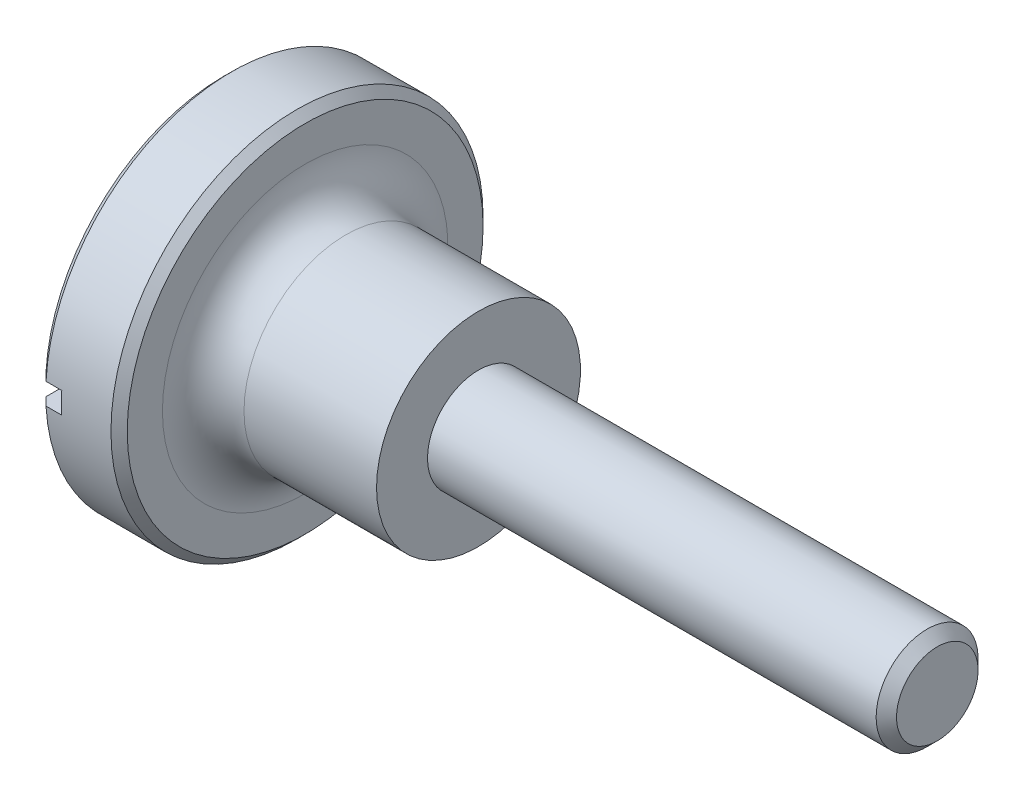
ISO-10303-21;
HEADER;
FILE_DESCRIPTION(('STEP AP214'),'2;1');
FILE_NAME('part.step','',(''),(''),'','','');
FILE_SCHEMA(('AUTOMOTIVE_DESIGN { 1 0 10303 214 1 1 1 1 }'));
ENDSEC;
DATA;
#1=APPLICATION_CONTEXT('core data for automotive mechanical design processes');
#2=APPLICATION_PROTOCOL_DEFINITION('international standard','automotive_design',2000,#1);
#3=PRODUCT_CONTEXT('',#1,'mechanical');
#4=PRODUCT('Part','Part','',(#3));
#5=PRODUCT_RELATED_PRODUCT_CATEGORY('part','',(#4));
#6=PRODUCT_DEFINITION_FORMATION('','',#4);
#7=PRODUCT_DEFINITION_CONTEXT('part definition',#1,'design');
#8=PRODUCT_DEFINITION('design','',#6,#7);
#9=PRODUCT_DEFINITION_SHAPE('','',#8);
#10=(LENGTH_UNIT() NAMED_UNIT(*) SI_UNIT(.MILLI.,.METRE.));
#11=(NAMED_UNIT(*) PLANE_ANGLE_UNIT() SI_UNIT($,.RADIAN.));
#12=(NAMED_UNIT(*) SI_UNIT($,.STERADIAN.) SOLID_ANGLE_UNIT());
#13=UNCERTAINTY_MEASURE_WITH_UNIT(LENGTH_MEASURE(1.E-05),#10,'distance_accuracy_value','');
#14=(GEOMETRIC_REPRESENTATION_CONTEXT(3) GLOBAL_UNCERTAINTY_ASSIGNED_CONTEXT((#13)) GLOBAL_UNIT_ASSIGNED_CONTEXT((#10,
#11,#12)) REPRESENTATION_CONTEXT('',''));
#15=CARTESIAN_POINT('',(0.,0.,0.));
#16=DIRECTION('',(0.,0.,1.));
#17=DIRECTION('',(1.,0.,0.));
#18=AXIS2_PLACEMENT_3D('',#15,#16,#17);
#19=CARTESIAN_POINT('',(0.799999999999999,0.,0.));
#20=DIRECTION('',(1.,0.,0.));
#21=DIRECTION('',(0.,0.,-1.));
#22=AXIS2_PLACEMENT_3D('',#19,#20,#21);
#23=CONICAL_SURFACE('',#22,18.25,0.785398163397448);
#24=CARTESIAN_POINT('',(0.799999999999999,0.,0.));
#25=DIRECTION('',(-1.,0.,0.));
#26=DIRECTION('',(0.,0.,1.));
#27=AXIS2_PLACEMENT_3D('',#24,#25,#26);
#28=CIRCLE('',#27,18.25);
#29=CARTESIAN_POINT('',(0.799999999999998,1.05069502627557,18.2197294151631));
#30=VERTEX_POINT('',#29);
#31=CARTESIAN_POINT('',(0.799999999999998,1.05069502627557,-18.2197294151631));
#32=VERTEX_POINT('',#31);
#33=EDGE_CURVE('E164',#30,#32,#28,.T.);
#34=ORIENTED_EDGE('',*,*,#33,.T.);
#35=CARTESIAN_POINT('',(22.7054596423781,1.05069502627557,-40.141711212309));
#36=CARTESIAN_POINT('',(21.3218955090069,1.05069502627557,-38.7576692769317));
#37=CARTESIAN_POINT('',(19.9383521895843,1.05069502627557,-37.3736065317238));
#38=CARTESIAN_POINT('',(17.1713337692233,1.05069502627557,-34.6054114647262));
#39=CARTESIAN_POINT('',(15.7878586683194,1.05069502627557,-33.221279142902));
#40=CARTESIAN_POINT('',(13.0209888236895,1.05069502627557,-30.4529025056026));
#41=CARTESIAN_POINT('',(11.637594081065,1.05069502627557,-29.0686581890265));
#42=CARTESIAN_POINT('',(8.87095102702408,1.05069502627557,-26.3000245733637));
#43=CARTESIAN_POINT('',(7.48770271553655,1.05069502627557,-24.9156352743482));
#44=CARTESIAN_POINT('',(4.7169129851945,1.05069502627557,-22.1420843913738));
#45=CARTESIAN_POINT('',(3.32937234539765,1.05069502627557,-20.7529220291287));
#46=CARTESIAN_POINT('',(0.554702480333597,1.05069502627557,-17.9741824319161));
#47=CARTESIAN_POINT('',(-0.832426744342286,1.05069502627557,-16.584605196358));
#48=CARTESIAN_POINT('',(-2.91246387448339,1.05069502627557,-14.4995940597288));
#49=CARTESIAN_POINT('',(-3.60569764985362,1.05069502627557,-13.8044852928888));
#50=CARTESIAN_POINT('',(-4.99181820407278,1.05069502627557,-12.4139210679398));
#51=CARTESIAN_POINT('',(-5.68470498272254,1.05069502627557,-11.7184656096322));
#52=CARTESIAN_POINT('',(-7.06991038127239,1.05069502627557,-10.3269924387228));
#53=CARTESIAN_POINT('',(-7.76222900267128,1.05069502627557,-9.63097472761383));
#54=CARTESIAN_POINT('',(-8.79989856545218,1.05069502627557,-8.58614586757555));
#55=CARTESIAN_POINT('',(-9.14565353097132,1.05069502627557,-8.23773602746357));
#56=CARTESIAN_POINT('',(-9.83676739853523,1.05069502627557,-7.54052380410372));
#57=CARTESIAN_POINT('',(-10.1821263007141,1.05069502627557,-7.19172142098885));
#58=CARTESIAN_POINT('',(-10.7159639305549,1.05069502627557,-6.6516246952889));
#59=CARTESIAN_POINT('',(-10.9046548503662,1.05069502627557,-6.46054011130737));
#60=CARTESIAN_POINT('',(-11.2817992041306,1.05069502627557,-6.07813646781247));
#61=CARTESIAN_POINT('',(-11.4702526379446,1.05069502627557,-5.88681740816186));
#62=CARTESIAN_POINT('',(-11.8467750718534,1.05069502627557,-5.50394231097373));
#63=CARTESIAN_POINT('',(-12.0348441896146,1.05069502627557,-5.31238638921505));
#64=CARTESIAN_POINT('',(-12.4105497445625,1.05069502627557,-4.9288512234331));
#65=CARTESIAN_POINT('',(-12.5981861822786,1.05069502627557,-4.73687197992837));
#66=CARTESIAN_POINT('',(-13.0361596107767,1.05069502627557,-4.28735976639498));
#67=CARTESIAN_POINT('',(-13.2862597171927,1.05069502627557,-4.02959543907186));
#68=CARTESIAN_POINT('',(-13.6600997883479,1.05069502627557,-3.64150646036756));
#69=CARTESIAN_POINT('',(-13.7845392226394,1.05069502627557,-3.51185626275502));
#70=CARTESIAN_POINT('',(-14.0327604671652,1.05069502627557,-3.25192992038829));
#71=CARTESIAN_POINT('',(-14.1565422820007,1.05069502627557,-3.12165378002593));
#72=CARTESIAN_POINT('',(-14.4450744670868,1.05069502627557,-2.8158579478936));
#73=CARTESIAN_POINT('',(-14.6094642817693,1.05069502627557,-2.63999599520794));
#74=CARTESIAN_POINT('',(-14.8537361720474,1.05069502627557,-2.37440544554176));
#75=CARTESIAN_POINT('',(-14.9346935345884,1.05069502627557,-2.28566677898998));
#76=CARTESIAN_POINT('',(-15.0956109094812,1.05069502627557,-2.10729289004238));
#77=CARTESIAN_POINT('',(-15.175570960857,1.05069502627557,-2.0176577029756));
#78=CARTESIAN_POINT('',(-15.3078557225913,1.05069502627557,-1.86699022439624));
#79=CARTESIAN_POINT('',(-15.3605734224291,1.05069502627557,-1.80630336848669));
#80=CARTESIAN_POINT('',(-15.4651721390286,1.05069502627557,-1.68421365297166));
#81=CARTESIAN_POINT('',(-15.5170531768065,1.05069502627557,-1.622810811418));
#82=CARTESIAN_POINT('',(-15.6200289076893,1.05069502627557,-1.49868100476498));
#83=CARTESIAN_POINT('',(-15.6711164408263,1.05069502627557,-1.4359480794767));
#84=CARTESIAN_POINT('',(-15.7717279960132,1.05069502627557,-1.30924488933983));
#85=CARTESIAN_POINT('',(-15.821252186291,1.05069502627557,-1.24527475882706));
#86=CARTESIAN_POINT('',(-15.91873580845,1.05069502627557,-1.11477529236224));
#87=CARTESIAN_POINT('',(-15.9666646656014,1.05069502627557,-1.04822294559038));
#88=CARTESIAN_POINT('',(-16.0591623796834,1.05069502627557,-0.912651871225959));
#89=CARTESIAN_POINT('',(-16.1037266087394,1.05069502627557,-0.843629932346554));
#90=CARTESIAN_POINT('',(-16.1870616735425,1.05069502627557,-0.703026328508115));
#91=CARTESIAN_POINT('',(-16.2258845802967,1.05069502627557,-0.631476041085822));
#92=CARTESIAN_POINT('',(-16.2948566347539,1.05069502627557,-0.484334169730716));
#93=CARTESIAN_POINT('',(-16.3250332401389,1.05069502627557,-0.40875630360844));
#94=CARTESIAN_POINT('',(-16.359046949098,1.05069502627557,-0.295574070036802));
#95=CARTESIAN_POINT('',(-16.368293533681,1.05069502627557,-0.259602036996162));
#96=CARTESIAN_POINT('',(-16.383395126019,1.05069502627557,-0.186941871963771));
#97=CARTESIAN_POINT('',(-16.3892506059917,1.05069502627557,-0.150253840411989));
#98=CARTESIAN_POINT('',(-16.3971456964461,1.05069502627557,-0.0766392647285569));
#99=CARTESIAN_POINT('',(-16.3992034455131,1.05069502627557,-0.0397147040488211));
#100=CARTESIAN_POINT('',(-16.3993991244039,1.05069502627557,0.0341463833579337));
#101=CARTESIAN_POINT('',(-16.3975369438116,1.05069502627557,0.0710829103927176));
#102=CARTESIAN_POINT('',(-16.3900577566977,1.05069502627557,0.144360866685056));
#103=CARTESIAN_POINT('',(-16.3844613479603,1.05069502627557,0.180704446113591));
#104=CARTESIAN_POINT('',(-16.3699163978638,1.05069502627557,0.252717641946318));
#105=CARTESIAN_POINT('',(-16.3609664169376,1.05069502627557,0.288386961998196));
#106=CARTESIAN_POINT('',(-16.3401510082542,1.05069502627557,0.359103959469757));
#107=CARTESIAN_POINT('',(-16.3282669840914,1.05069502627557,0.39414607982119));
#108=CARTESIAN_POINT('',(-16.3021331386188,1.05069502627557,0.463317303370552));
#109=CARTESIAN_POINT('',(-16.2878836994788,1.05069502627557,0.497446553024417));
#110=CARTESIAN_POINT('',(-16.2453698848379,1.05069502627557,0.591696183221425));
#111=CARTESIAN_POINT('',(-16.2149856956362,1.05069502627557,0.650856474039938));
#112=CARTESIAN_POINT('',(-16.1500902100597,1.05069502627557,0.766888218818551));
#113=CARTESIAN_POINT('',(-16.1155743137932,1.05069502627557,0.823757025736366));
#114=CARTESIAN_POINT('',(-16.0435935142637,1.05069502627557,0.935879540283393));
#115=CARTESIAN_POINT('',(-16.0061181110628,1.05069502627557,0.991126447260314));
#116=CARTESIAN_POINT('',(-15.9291910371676,1.05069502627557,1.1001773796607));
#117=CARTESIAN_POINT('',(-15.8897402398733,1.05069502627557,1.15398202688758));
#118=CARTESIAN_POINT('',(-15.8090139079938,1.05069502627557,1.26099932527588));
#119=CARTESIAN_POINT('',(-15.7677246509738,1.05069502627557,1.31420157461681));
#120=CARTESIAN_POINT('',(-15.684047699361,1.05069502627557,1.41973949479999));
#121=CARTESIAN_POINT('',(-15.6416599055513,1.05069502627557,1.47207508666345));
#122=CARTESIAN_POINT('',(-15.5561519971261,1.05069502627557,1.57593353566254));
#123=CARTESIAN_POINT('',(-15.5130338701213,1.05069502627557,1.62745803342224));
#124=CARTESIAN_POINT('',(-15.4261510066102,1.05069502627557,1.72995410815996));
#125=CARTESIAN_POINT('',(-15.3823862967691,1.05069502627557,1.78092570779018));
#126=CARTESIAN_POINT('',(-15.2522627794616,1.05069502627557,1.93094394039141));
#127=CARTESIAN_POINT('',(-15.165182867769,1.05069502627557,2.02936467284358));
#128=CARTESIAN_POINT('',(-14.9897287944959,1.05069502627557,2.22504752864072));
#129=CARTESIAN_POINT('',(-14.901354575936,1.05069502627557,2.32230960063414));
#130=CARTESIAN_POINT('',(-14.7236859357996,1.05069502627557,2.51601215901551));
#131=CARTESIAN_POINT('',(-14.6343913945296,1.05069502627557,2.61245253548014));
#132=CARTESIAN_POINT('',(-14.4551394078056,1.05069502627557,2.80471574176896));
#133=CARTESIAN_POINT('',(-14.3651819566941,1.05069502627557,2.90053856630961));
#134=CARTESIAN_POINT('',(-14.0943601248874,1.05069502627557,3.18754022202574));
#135=CARTESIAN_POINT('',(-13.9127583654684,1.05069502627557,3.37802279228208));
#136=CARTESIAN_POINT('',(-13.5483954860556,1.05069502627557,3.75784378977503));
#137=CARTESIAN_POINT('',(-13.3656344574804,1.05069502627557,3.94718230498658));
#138=CARTESIAN_POINT('',(-13.000850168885,1.05069502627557,4.32355192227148));
#139=CARTESIAN_POINT('',(-12.8188332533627,1.05069502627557,4.51058917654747));
#140=CARTESIAN_POINT('',(-12.454272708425,1.05069502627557,4.88415662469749));
#141=CARTESIAN_POINT('',(-12.2717290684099,1.05069502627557,5.07068680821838));
#142=CARTESIAN_POINT('',(-11.9063556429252,1.05069502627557,5.44328614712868));
#143=CARTESIAN_POINT('',(-11.7235260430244,1.05069502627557,5.62935548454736));
#144=CARTESIAN_POINT('',(-11.3575880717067,1.05069502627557,6.00121730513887));
#145=CARTESIAN_POINT('',(-11.1744797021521,1.05069502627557,6.1870097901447));
#146=CARTESIAN_POINT('',(-10.6244201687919,1.05069502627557,6.7444996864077));
#147=CARTESIAN_POINT('',(-10.2571521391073,1.05069502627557,7.11588441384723));
#148=CARTESIAN_POINT('',(-9.52209469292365,1.05069502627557,7.85813763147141));
#149=CARTESIAN_POINT('',(-9.15430527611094,1.05069502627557,8.22900612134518));
#150=CARTESIAN_POINT('',(-8.05042435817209,1.05069502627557,9.34110840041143));
#151=CARTESIAN_POINT('',(-7.31382306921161,1.05069502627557,10.0818360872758));
#152=CARTESIAN_POINT('',(-5.83981087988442,1.05069502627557,11.5627613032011));
#153=CARTESIAN_POINT('',(-5.10239985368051,1.05069502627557,12.3029587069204));
#154=CARTESIAN_POINT('',(-3.62718167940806,1.05069502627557,13.7829563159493));
#155=CARTESIAN_POINT('',(-2.88937453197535,1.05069502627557,14.5227565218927));
#156=CARTESIAN_POINT('',(-1.41109299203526,1.05069502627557,16.0045353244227));
#157=CARTESIAN_POINT('',(-0.670617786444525,1.05069502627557,16.7465131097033));
#158=CARTESIAN_POINT('',(0.810500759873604,1.05069502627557,18.230301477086));
#159=CARTESIAN_POINT('',(1.55114410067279,1.05069502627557,18.9721120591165));
#160=CARTESIAN_POINT('',(3.77316906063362,1.05069502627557,21.197293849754));
#161=CARTESIAN_POINT('',(5.25472316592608,1.05069502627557,22.6804928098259));
#162=CARTESIAN_POINT('',(8.06896911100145,1.05069502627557,25.4973934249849));
#163=CARTESIAN_POINT('',(9.40163731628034,1.05069502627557,26.8311186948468));
#164=CARTESIAN_POINT('',(12.0671260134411,1.05069502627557,29.4984618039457));
#165=CARTESIAN_POINT('',(13.3999465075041,1.05069502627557,30.8320796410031));
#166=CARTESIAN_POINT('',(16.061525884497,1.05069502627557,33.4950786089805));
#167=CARTESIAN_POINT('',(17.3902844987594,1.05069502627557,34.8244600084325));
#168=CARTESIAN_POINT('',(20.0478420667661,1.05069502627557,37.4831378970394));
#169=CARTESIAN_POINT('',(21.3766410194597,1.05069502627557,38.8124343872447));
#170=CARTESIAN_POINT('',(22.7054596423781,1.05069502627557,40.141711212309));
#171=B_SPLINE_CURVE_WITH_KNOTS('',3,(#35,#36,#37,#38,#39,#40,#41,#42,#43,#44,#45,#46,#47,#48,
#49,#50,#51,#52,#53,#54,#55,#56,#57,#58,#59,#60,#61,#62,#63,#64,#65,#66,#67,#68,#69,#70,#71,#72,
#73,#74,#75,#76,#77,#78,#79,#80,#81,#82,#83,#84,#85,#86,#87,#88,#89,#90,#91,#92,#93,#94,#95,#96,
#97,#98,#99,#100,#101,#102,#103,#104,#105,#106,#107,#108,#109,#110,#111,#112,#113,#114,#115,
#116,#117,#118,#119,#120,#121,#122,#123,#124,#125,#126,#127,#128,#129,#130,#131,#132,#133,#134,
#135,#136,#137,#138,#139,#140,#141,#142,#143,#144,#145,#146,#147,#148,#149,#150,#151,#152,#153,
#154,#155,#156,#157,#158,#159,#160,#161,#162,#163,#164,#165,#166,#167,#168,#169,#170),
.UNSPECIFIED.,.F.,.F.,(4,2,2,2,2,2,2,2,2,2,2,2,2,2,2,2,2,2,2,2,2,2,2,2,2,2,2,2,2,2,2,2,2,2,2,2,
2,2,2,2,2,2,2,2,2,2,2,2,2,2,2,2,2,2,2,2,2,2,2,2,2,2,2,2,2,2,2,4),(0.,5.87097914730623,
11.7419612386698,17.6130105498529,23.4840569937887,29.3743345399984,35.2646205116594,
38.2097423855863,41.1548659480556,44.0999817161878,45.5725382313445,47.045094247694,
47.8507355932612,48.6563774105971,49.4617170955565,50.2670557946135,51.3445152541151,
51.8836320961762,52.4227451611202,53.1449153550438,53.5052685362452,53.8656075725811,
54.1067626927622,54.3479117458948,54.5906045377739,54.8332711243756,55.0792491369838,
55.325559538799,55.5694773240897,55.8126117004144,55.923901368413,56.0351755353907,
56.1459168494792,56.2566612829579,56.3667998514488,56.4769857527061,56.5878888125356,
56.6987739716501,56.8980182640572,57.0974864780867,57.2976972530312,57.4978202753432,
57.6998347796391,57.9018675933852,58.1034185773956,58.3049612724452,58.6991822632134,
59.0934206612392,59.4877109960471,59.8820046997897,60.6715294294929,61.4609926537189,
62.2439456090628,63.0269144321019,63.8094970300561,64.592074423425,66.1590168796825,
67.7259602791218,70.8598593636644,73.9943456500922,77.12882692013,80.2735861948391,
83.4183468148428,89.707538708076,95.3638138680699,101.020183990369,106.658950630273,
112.297622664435),.UNSPECIFIED.);
#172=CARTESIAN_POINT('',(0.,1.05069502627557,-17.4183391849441));
#173=VERTEX_POINT('',#172);
#174=EDGE_CURVE('E56',#32,#173,#171,.T.);
#175=ORIENTED_EDGE('',*,*,#174,.T.);
#176=CARTESIAN_POINT('',(0.,0.,0.));
#177=DIRECTION('',(-1.,0.,0.));
#178=DIRECTION('',(0.,0.,1.));
#179=AXIS2_PLACEMENT_3D('',#176,#177,#178);
#180=CIRCLE('',#179,17.45);
#181=CARTESIAN_POINT('',(0.,1.05069502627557,17.4183391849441));
#182=VERTEX_POINT('',#181);
#183=EDGE_CURVE('E173',#182,#173,#180,.T.);
#184=ORIENTED_EDGE('',*,*,#183,.F.);
#185=EDGE_CURVE('E110',#182,#30,#171,.T.);
#186=ORIENTED_EDGE('',*,*,#185,.T.);
#187=EDGE_LOOP('',(#34,#175,#184,#186));
#188=FACE_BOUND('',#187,.T.);
#189=ADVANCED_FACE('F33',(#188),#23,.T.);
#190=CARTESIAN_POINT('',(0.,0.,0.));
#191=DIRECTION('',(-1.,0.,0.));
#192=DIRECTION('',(0.,0.,1.));
#193=AXIS2_PLACEMENT_3D('',#190,#191,#192);
#194=PLANE('',#193);
#195=DIRECTION('',(0.,0.,-1.));
#196=VECTOR('',#195,1.);
#197=CARTESIAN_POINT('',(0.,1.05069502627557,0.));
#198=LINE('',#197,#196);
#199=EDGE_CURVE('E187',#182,#173,#198,.T.);
#200=ORIENTED_EDGE('',*,*,#199,.F.);
#201=ORIENTED_EDGE('',*,*,#183,.T.);
#202=EDGE_LOOP('',(#200,#201));
#203=FACE_BOUND('',#202,.T.);
#204=ADVANCED_FACE('F150',(#203),#194,.T.);
#205=CARTESIAN_POINT('',(-25.4,0.,0.));
#206=DIRECTION('',(-1.,0.,0.));
#207=DIRECTION('',(0.,0.,1.));
#208=AXIS2_PLACEMENT_3D('',#205,#206,#207);
#209=CYLINDRICAL_SURFACE('',#208,5.);
#210=CARTESIAN_POINT('',(69.,0.,0.));
#211=DIRECTION('',(-1.,0.,0.));
#212=DIRECTION('',(0.,0.,1.));
#213=AXIS2_PLACEMENT_3D('',#210,#211,#212);
#214=CIRCLE('',#213,5.);
#215=CARTESIAN_POINT('',(69.,0.,5.));
#216=VERTEX_POINT('',#215);
#217=EDGE_CURVE('E316',#216,#216,#214,.T.);
#218=ORIENTED_EDGE('',*,*,#217,.T.);
#219=EDGE_LOOP('',(#218));
#220=FACE_BOUND('',#219,.T.);
#221=CARTESIAN_POINT('',(25.,0.,0.));
#222=DIRECTION('',(-1.,0.,0.));
#223=DIRECTION('',(0.,0.,1.));
#224=AXIS2_PLACEMENT_3D('',#221,#222,#223);
#225=CIRCLE('',#224,5.);
#226=CARTESIAN_POINT('',(25.,0.,5.));
#227=VERTEX_POINT('',#226);
#228=EDGE_CURVE('E182',#227,#227,#225,.T.);
#229=ORIENTED_EDGE('',*,*,#228,.F.);
#230=EDGE_LOOP('',(#229));
#231=FACE_BOUND('',#230,.T.);
#232=ADVANCED_FACE('F156',(#220,#231),#209,.T.);
#233=CARTESIAN_POINT('',(25.,9.99999999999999,0.));
#234=DIRECTION('',(1.,0.,0.));
#235=DIRECTION('',(0.,0.,-1.));
#236=AXIS2_PLACEMENT_3D('',#233,#234,#235);
#237=PLANE('',#236);
#238=ORIENTED_EDGE('',*,*,#228,.T.);
#239=EDGE_LOOP('',(#238));
#240=FACE_BOUND('',#239,.T.);
#241=CARTESIAN_POINT('',(25.,0.,0.));
#242=DIRECTION('',(-1.,0.,0.));
#243=DIRECTION('',(0.,0.,1.));
#244=AXIS2_PLACEMENT_3D('',#241,#242,#243);
#245=CIRCLE('',#244,9.99999999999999);
#246=CARTESIAN_POINT('',(25.,0.,9.99999999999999));
#247=VERTEX_POINT('',#246);
#248=EDGE_CURVE('E179',#247,#247,#245,.T.);
#249=ORIENTED_EDGE('',*,*,#248,.F.);
#250=EDGE_LOOP('',(#249));
#251=FACE_BOUND('',#250,.T.);
#252=ADVANCED_FACE('F203',(#240,#251),#237,.T.);
#253=CARTESIAN_POINT('',(-25.4,0.,0.));
#254=DIRECTION('',(-1.,0.,0.));
#255=DIRECTION('',(0.,0.,1.));
#256=AXIS2_PLACEMENT_3D('',#253,#254,#255);
#257=CYLINDRICAL_SURFACE('',#256,9.99999999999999);
#258=CARTESIAN_POINT('',(12.,0.,0.));
#259=DIRECTION('',(-1.,0.,0.));
#260=DIRECTION('',(0.,0.,1.));
#261=AXIS2_PLACEMENT_3D('',#258,#259,#260);
#262=CIRCLE('',#261,9.99999999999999);
#263=CARTESIAN_POINT('',(12.,0.,9.99999999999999));
#264=VERTEX_POINT('',#263);
#265=EDGE_CURVE('E11',#264,#264,#262,.F.);
#266=ORIENTED_EDGE('',*,*,#265,.T.);
#267=EDGE_LOOP('',(#266));
#268=FACE_BOUND('',#267,.T.);
#269=ORIENTED_EDGE('',*,*,#248,.T.);
#270=EDGE_LOOP('',(#269));
#271=FACE_BOUND('',#270,.T.);
#272=ADVANCED_FACE('F200',(#268,#271),#257,.T.);
#273=CARTESIAN_POINT('',(8.,9.99999999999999,0.));
#274=DIRECTION('',(-1.,0.,0.));
#275=DIRECTION('',(0.,0.,1.));
#276=AXIS2_PLACEMENT_3D('',#273,#274,#275);
#277=PLANE('',#276);
#278=CARTESIAN_POINT('',(8.,0.,0.));
#279=DIRECTION('',(-1.,0.,0.));
#280=DIRECTION('',(0.,0.,1.));
#281=AXIS2_PLACEMENT_3D('',#278,#279,#280);
#282=CIRCLE('',#281,14.);
#283=CARTESIAN_POINT('',(8.,0.,14.));
#284=VERTEX_POINT('',#283);
#285=EDGE_CURVE('E41',#284,#284,#282,.T.);
#286=ORIENTED_EDGE('',*,*,#285,.T.);
#287=EDGE_LOOP('',(#286));
#288=FACE_BOUND('',#287,.T.);
#289=CARTESIAN_POINT('',(7.99999999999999,0.,0.));
#290=DIRECTION('',(-1.,0.,0.));
#291=DIRECTION('',(0.,0.,1.));
#292=AXIS2_PLACEMENT_3D('',#289,#290,#291);
#293=CIRCLE('',#292,17.45);
#294=CARTESIAN_POINT('',(7.99999999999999,0.,17.45));
#295=VERTEX_POINT('',#294);
#296=EDGE_CURVE('E171',#295,#295,#293,.T.);
#297=ORIENTED_EDGE('',*,*,#296,.F.);
#298=EDGE_LOOP('',(#297));
#299=FACE_BOUND('',#298,.T.);
#300=ADVANCED_FACE('F191',(#288,#299),#277,.F.);
#301=CARTESIAN_POINT('',(7.2,0.,0.));
#302=DIRECTION('',(-1.,0.,0.));
#303=DIRECTION('',(0.,0.,1.));
#304=AXIS2_PLACEMENT_3D('',#301,#302,#303);
#305=CONICAL_SURFACE('',#304,18.25,0.785398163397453);
#306=ORIENTED_EDGE('',*,*,#296,.T.);
#307=EDGE_LOOP('',(#306));
#308=FACE_BOUND('',#307,.T.);
#309=CARTESIAN_POINT('',(7.2,0.,0.));
#310=DIRECTION('',(-1.,0.,0.));
#311=DIRECTION('',(0.,0.,1.));
#312=AXIS2_PLACEMENT_3D('',#309,#310,#311);
#313=CIRCLE('',#312,18.25);
#314=CARTESIAN_POINT('',(7.2,0.,18.25));
#315=VERTEX_POINT('',#314);
#316=EDGE_CURVE('E168',#315,#315,#313,.T.);
#317=ORIENTED_EDGE('',*,*,#316,.F.);
#318=EDGE_LOOP('',(#317));
#319=FACE_BOUND('',#318,.T.);
#320=ADVANCED_FACE('F217',(#308,#319),#305,.T.);
#321=CARTESIAN_POINT('',(-25.4,0.,0.));
#322=DIRECTION('',(-1.,0.,0.));
#323=DIRECTION('',(0.,0.,1.));
#324=AXIS2_PLACEMENT_3D('',#321,#322,#323);
#325=CYLINDRICAL_SURFACE('',#324,18.25);
#326=DIRECTION('',(-1.,0.,0.));
#327=VECTOR('',#326,1.);
#328=CARTESIAN_POINT('',(-25.4,1.05069502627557,-18.2197294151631));
#329=LINE('',#328,#327);
#330=CARTESIAN_POINT('',(2.34655222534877,1.05069502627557,-18.2197294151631));
#331=VERTEX_POINT('',#330);
#332=EDGE_CURVE('E319',#32,#331,#329,.F.);
#333=ORIENTED_EDGE('',*,*,#332,.F.);
#334=ORIENTED_EDGE('',*,*,#33,.F.);
#335=DIRECTION('',(-1.,0.,0.));
#336=VECTOR('',#335,1.);
#337=CARTESIAN_POINT('',(-25.4,1.05069502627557,18.2197294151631));
#338=LINE('',#337,#336);
#339=CARTESIAN_POINT('',(2.34655222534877,1.05069502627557,18.2197294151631));
#340=VERTEX_POINT('',#339);
#341=EDGE_CURVE('E126',#340,#30,#338,.T.);
#342=ORIENTED_EDGE('',*,*,#341,.F.);
#343=CARTESIAN_POINT('',(2.34655222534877,0.,0.));
#344=DIRECTION('',(1.,0.,0.));
#345=DIRECTION('',(0.,1.,0.));
#346=AXIS2_PLACEMENT_3D('',#343,#344,#345);
#347=CIRCLE('',#346,18.25);
#348=CARTESIAN_POINT('',(2.34655222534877,-1.05069502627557,18.2197294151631));
#349=VERTEX_POINT('',#348);
#350=EDGE_CURVE('E95',#349,#340,#347,.F.);
#351=ORIENTED_EDGE('',*,*,#350,.F.);
#352=DIRECTION('',(-1.,0.,0.));
#353=VECTOR('',#352,1.);
#354=CARTESIAN_POINT('',(-25.4,-1.05069502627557,18.2197294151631));
#355=LINE('',#354,#353);
#356=CARTESIAN_POINT('',(0.799999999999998,-1.05069502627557,18.2197294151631));
#357=VERTEX_POINT('',#356);
#358=EDGE_CURVE('E101',#357,#349,#355,.F.);
#359=ORIENTED_EDGE('',*,*,#358,.F.);
#360=CARTESIAN_POINT('',(0.799999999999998,-1.05069502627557,-18.2197294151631));
#361=VERTEX_POINT('',#360);
#362=EDGE_CURVE('E107',#361,#357,#28,.T.);
#363=ORIENTED_EDGE('',*,*,#362,.F.);
#364=DIRECTION('',(-1.,0.,0.));
#365=VECTOR('',#364,1.);
#366=CARTESIAN_POINT('',(-25.4,-1.05069502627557,-18.2197294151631));
#367=LINE('',#366,#365);
#368=CARTESIAN_POINT('',(2.34655222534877,-1.05069502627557,-18.2197294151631));
#369=VERTEX_POINT('',#368);
#370=EDGE_CURVE('E99',#369,#361,#367,.T.);
#371=ORIENTED_EDGE('',*,*,#370,.F.);
#372=EDGE_CURVE('E87',#331,#369,#347,.F.);
#373=ORIENTED_EDGE('',*,*,#372,.F.);
#374=EDGE_LOOP('',(#333,#334,#342,#351,#359,#363,#371,#373));
#375=FACE_BOUND('',#374,.T.);
#376=ORIENTED_EDGE('',*,*,#316,.T.);
#377=EDGE_LOOP('',(#376));
#378=FACE_BOUND('',#377,.T.);
#379=ADVANCED_FACE('F104',(#375,#378),#325,.T.);
#380=ORIENTED_EDGE('',*,*,#362,.T.);
#381=CARTESIAN_POINT('',(22.7054596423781,-1.05069502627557,40.141711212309));
#382=CARTESIAN_POINT('',(21.3218955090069,-1.05069502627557,38.7576692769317));
#383=CARTESIAN_POINT('',(19.9383521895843,-1.05069502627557,37.3736065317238));
#384=CARTESIAN_POINT('',(17.1713337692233,-1.05069502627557,34.6054114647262));
#385=CARTESIAN_POINT('',(15.7878586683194,-1.05069502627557,33.221279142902));
#386=CARTESIAN_POINT('',(13.0209888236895,-1.05069502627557,30.4529025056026));
#387=CARTESIAN_POINT('',(11.637594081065,-1.05069502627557,29.0686581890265));
#388=CARTESIAN_POINT('',(8.87095102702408,-1.05069502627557,26.3000245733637));
#389=CARTESIAN_POINT('',(7.48770271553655,-1.05069502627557,24.9156352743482));
#390=CARTESIAN_POINT('',(4.7169129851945,-1.05069502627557,22.1420843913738));
#391=CARTESIAN_POINT('',(3.32937234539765,-1.05069502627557,20.7529220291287));
#392=CARTESIAN_POINT('',(0.554702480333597,-1.05069502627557,17.9741824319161));
#393=CARTESIAN_POINT('',(-0.832426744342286,-1.05069502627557,16.584605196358));
#394=CARTESIAN_POINT('',(-2.91246387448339,-1.05069502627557,14.4995940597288));
#395=CARTESIAN_POINT('',(-3.60569764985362,-1.05069502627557,13.8044852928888));
#396=CARTESIAN_POINT('',(-4.99181820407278,-1.05069502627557,12.4139210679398));
#397=CARTESIAN_POINT('',(-5.68470498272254,-1.05069502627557,11.7184656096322));
#398=CARTESIAN_POINT('',(-7.06991038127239,-1.05069502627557,10.3269924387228));
#399=CARTESIAN_POINT('',(-7.76222900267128,-1.05069502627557,9.63097472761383));
#400=CARTESIAN_POINT('',(-8.79989856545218,-1.05069502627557,8.58614586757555));
#401=CARTESIAN_POINT('',(-9.14565353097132,-1.05069502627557,8.23773602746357));
#402=CARTESIAN_POINT('',(-9.83676739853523,-1.05069502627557,7.54052380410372));
#403=CARTESIAN_POINT('',(-10.1821263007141,-1.05069502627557,7.19172142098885));
#404=CARTESIAN_POINT('',(-10.7159639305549,-1.05069502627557,6.6516246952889));
#405=CARTESIAN_POINT('',(-10.9046548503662,-1.05069502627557,6.46054011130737));
#406=CARTESIAN_POINT('',(-11.2817992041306,-1.05069502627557,6.07813646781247));
#407=CARTESIAN_POINT('',(-11.4702526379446,-1.05069502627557,5.88681740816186));
#408=CARTESIAN_POINT('',(-11.8467750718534,-1.05069502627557,5.50394231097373));
#409=CARTESIAN_POINT('',(-12.0348441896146,-1.05069502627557,5.31238638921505));
#410=CARTESIAN_POINT('',(-12.4105497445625,-1.05069502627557,4.9288512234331));
#411=CARTESIAN_POINT('',(-12.5981861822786,-1.05069502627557,4.73687197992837));
#412=CARTESIAN_POINT('',(-13.0361596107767,-1.05069502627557,4.28735976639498));
#413=CARTESIAN_POINT('',(-13.2862597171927,-1.05069502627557,4.02959543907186));
#414=CARTESIAN_POINT('',(-13.6600997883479,-1.05069502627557,3.64150646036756));
#415=CARTESIAN_POINT('',(-13.7845392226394,-1.05069502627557,3.51185626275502));
#416=CARTESIAN_POINT('',(-14.0327604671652,-1.05069502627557,3.25192992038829));
#417=CARTESIAN_POINT('',(-14.1565422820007,-1.05069502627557,3.12165378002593));
#418=CARTESIAN_POINT('',(-14.4450744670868,-1.05069502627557,2.8158579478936));
#419=CARTESIAN_POINT('',(-14.6094642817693,-1.05069502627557,2.63999599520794));
#420=CARTESIAN_POINT('',(-14.8537361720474,-1.05069502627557,2.37440544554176));
#421=CARTESIAN_POINT('',(-14.9346935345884,-1.05069502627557,2.28566677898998));
#422=CARTESIAN_POINT('',(-15.0956109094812,-1.05069502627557,2.10729289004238));
#423=CARTESIAN_POINT('',(-15.175570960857,-1.05069502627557,2.0176577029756));
#424=CARTESIAN_POINT('',(-15.3078557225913,-1.05069502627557,1.86699022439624));
#425=CARTESIAN_POINT('',(-15.3605734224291,-1.05069502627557,1.80630336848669));
#426=CARTESIAN_POINT('',(-15.4651721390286,-1.05069502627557,1.68421365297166));
#427=CARTESIAN_POINT('',(-15.5170531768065,-1.05069502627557,1.622810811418));
#428=CARTESIAN_POINT('',(-15.6200289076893,-1.05069502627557,1.49868100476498));
#429=CARTESIAN_POINT('',(-15.6711164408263,-1.05069502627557,1.4359480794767));
#430=CARTESIAN_POINT('',(-15.7717279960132,-1.05069502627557,1.30924488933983));
#431=CARTESIAN_POINT('',(-15.821252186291,-1.05069502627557,1.24527475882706));
#432=CARTESIAN_POINT('',(-15.91873580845,-1.05069502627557,1.11477529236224));
#433=CARTESIAN_POINT('',(-15.9666646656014,-1.05069502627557,1.04822294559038));
#434=CARTESIAN_POINT('',(-16.0591623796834,-1.05069502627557,0.912651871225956));
#435=CARTESIAN_POINT('',(-16.1037266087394,-1.05069502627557,0.843629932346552));
#436=CARTESIAN_POINT('',(-16.1870616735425,-1.05069502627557,0.703026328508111));
#437=CARTESIAN_POINT('',(-16.2258845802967,-1.05069502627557,0.631476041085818));
#438=CARTESIAN_POINT('',(-16.2948566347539,-1.05069502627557,0.484334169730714));
#439=CARTESIAN_POINT('',(-16.3250332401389,-1.05069502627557,0.40875630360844));
#440=CARTESIAN_POINT('',(-16.359046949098,-1.05069502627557,0.295574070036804));
#441=CARTESIAN_POINT('',(-16.368293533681,-1.05069502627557,0.259602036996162));
#442=CARTESIAN_POINT('',(-16.383395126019,-1.05069502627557,0.186941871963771));
#443=CARTESIAN_POINT('',(-16.3892506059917,-1.05069502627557,0.150253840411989));
#444=CARTESIAN_POINT('',(-16.3971456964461,-1.05069502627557,0.0766392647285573));
#445=CARTESIAN_POINT('',(-16.3992034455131,-1.05069502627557,0.0397147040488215));
#446=CARTESIAN_POINT('',(-16.3993991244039,-1.05069502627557,-0.0341463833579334));
#447=CARTESIAN_POINT('',(-16.3975369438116,-1.05069502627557,-0.0710829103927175));
#448=CARTESIAN_POINT('',(-16.3900577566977,-1.05069502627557,-0.144360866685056));
#449=CARTESIAN_POINT('',(-16.3844613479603,-1.05069502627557,-0.180704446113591));
#450=CARTESIAN_POINT('',(-16.3699163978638,-1.05069502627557,-0.25271764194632));
#451=CARTESIAN_POINT('',(-16.3609664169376,-1.05069502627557,-0.288386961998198));
#452=CARTESIAN_POINT('',(-16.3401510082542,-1.05069502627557,-0.35910395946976));
#453=CARTESIAN_POINT('',(-16.3282669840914,-1.05069502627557,-0.394146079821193));
#454=CARTESIAN_POINT('',(-16.3021331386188,-1.05069502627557,-0.463317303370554));
#455=CARTESIAN_POINT('',(-16.2878836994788,-1.05069502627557,-0.497446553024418));
#456=CARTESIAN_POINT('',(-16.2453698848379,-1.05069502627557,-0.591696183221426));
#457=CARTESIAN_POINT('',(-16.2149856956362,-1.05069502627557,-0.650856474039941));
#458=CARTESIAN_POINT('',(-16.1500902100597,-1.05069502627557,-0.766888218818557));
#459=CARTESIAN_POINT('',(-16.1155743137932,-1.05069502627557,-0.823757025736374));
#460=CARTESIAN_POINT('',(-16.0435935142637,-1.05069502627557,-0.935879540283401));
#461=CARTESIAN_POINT('',(-16.0061181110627,-1.05069502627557,-0.991126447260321));
#462=CARTESIAN_POINT('',(-15.9291910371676,-1.05069502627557,-1.10017737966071));
#463=CARTESIAN_POINT('',(-15.8897402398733,-1.05069502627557,-1.15398202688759));
#464=CARTESIAN_POINT('',(-15.8090139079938,-1.05069502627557,-1.26099932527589));
#465=CARTESIAN_POINT('',(-15.7677246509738,-1.05069502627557,-1.31420157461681));
#466=CARTESIAN_POINT('',(-15.684047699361,-1.05069502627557,-1.41973949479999));
#467=CARTESIAN_POINT('',(-15.6416599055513,-1.05069502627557,-1.47207508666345));
#468=CARTESIAN_POINT('',(-15.5561519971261,-1.05069502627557,-1.57593353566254));
#469=CARTESIAN_POINT('',(-15.5130338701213,-1.05069502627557,-1.62745803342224));
#470=CARTESIAN_POINT('',(-15.4261510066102,-1.05069502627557,-1.72995410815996));
#471=CARTESIAN_POINT('',(-15.3823862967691,-1.05069502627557,-1.78092570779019));
#472=CARTESIAN_POINT('',(-15.2522627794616,-1.05069502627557,-1.93094394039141));
#473=CARTESIAN_POINT('',(-15.165182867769,-1.05069502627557,-2.02936467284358));
#474=CARTESIAN_POINT('',(-14.9897287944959,-1.05069502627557,-2.22504752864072));
#475=CARTESIAN_POINT('',(-14.901354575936,-1.05069502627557,-2.32230960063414));
#476=CARTESIAN_POINT('',(-14.7236859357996,-1.05069502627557,-2.51601215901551));
#477=CARTESIAN_POINT('',(-14.6343913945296,-1.05069502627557,-2.61245253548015));
#478=CARTESIAN_POINT('',(-14.4551394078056,-1.05069502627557,-2.80471574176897));
#479=CARTESIAN_POINT('',(-14.3651819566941,-1.05069502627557,-2.90053856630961));
#480=CARTESIAN_POINT('',(-14.0943601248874,-1.05069502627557,-3.18754022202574));
#481=CARTESIAN_POINT('',(-13.9127583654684,-1.05069502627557,-3.37802279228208));
#482=CARTESIAN_POINT('',(-13.5483954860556,-1.05069502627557,-3.75784378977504));
#483=CARTESIAN_POINT('',(-13.3656344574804,-1.05069502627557,-3.94718230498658));
#484=CARTESIAN_POINT('',(-13.000850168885,-1.05069502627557,-4.32355192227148));
#485=CARTESIAN_POINT('',(-12.8188332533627,-1.05069502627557,-4.51058917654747));
#486=CARTESIAN_POINT('',(-12.454272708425,-1.05069502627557,-4.88415662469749));
#487=CARTESIAN_POINT('',(-12.2717290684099,-1.05069502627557,-5.07068680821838));
#488=CARTESIAN_POINT('',(-11.9063556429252,-1.05069502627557,-5.44328614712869));
#489=CARTESIAN_POINT('',(-11.7235260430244,-1.05069502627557,-5.62935548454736));
#490=CARTESIAN_POINT('',(-11.3575880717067,-1.05069502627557,-6.00121730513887));
#491=CARTESIAN_POINT('',(-11.1744797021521,-1.05069502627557,-6.1870097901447));
#492=CARTESIAN_POINT('',(-10.6244201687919,-1.05069502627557,-6.7444996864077));
#493=CARTESIAN_POINT('',(-10.2571521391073,-1.05069502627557,-7.11588441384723));
#494=CARTESIAN_POINT('',(-9.52209469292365,-1.05069502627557,-7.8581376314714));
#495=CARTESIAN_POINT('',(-9.15430527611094,-1.05069502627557,-8.22900612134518));
#496=CARTESIAN_POINT('',(-8.05042435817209,-1.05069502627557,-9.34110840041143));
#497=CARTESIAN_POINT('',(-7.31382306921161,-1.05069502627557,-10.0818360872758));
#498=CARTESIAN_POINT('',(-5.83981087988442,-1.05069502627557,-11.5627613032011));
#499=CARTESIAN_POINT('',(-5.10239985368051,-1.05069502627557,-12.3029587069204));
#500=CARTESIAN_POINT('',(-3.62718167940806,-1.05069502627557,-13.7829563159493));
#501=CARTESIAN_POINT('',(-2.88937453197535,-1.05069502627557,-14.5227565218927));
#502=CARTESIAN_POINT('',(-1.41109299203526,-1.05069502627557,-16.0045353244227));
#503=CARTESIAN_POINT('',(-0.670617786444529,-1.05069502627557,-16.7465131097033));
#504=CARTESIAN_POINT('',(0.810500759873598,-1.05069502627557,-18.230301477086));
#505=CARTESIAN_POINT('',(1.55114410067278,-1.05069502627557,-18.9721120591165));
#506=CARTESIAN_POINT('',(3.77316906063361,-1.05069502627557,-21.197293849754));
#507=CARTESIAN_POINT('',(5.25472316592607,-1.05069502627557,-22.6804928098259));
#508=CARTESIAN_POINT('',(8.06896911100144,-1.05069502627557,-25.4973934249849));
#509=CARTESIAN_POINT('',(9.40163731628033,-1.05069502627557,-26.8311186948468));
#510=CARTESIAN_POINT('',(12.0671260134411,-1.05069502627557,-29.4984618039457));
#511=CARTESIAN_POINT('',(13.3999465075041,-1.05069502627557,-30.8320796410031));
#512=CARTESIAN_POINT('',(16.061525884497,-1.05069502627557,-33.4950786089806));
#513=CARTESIAN_POINT('',(17.3902844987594,-1.05069502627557,-34.8244600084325));
#514=CARTESIAN_POINT('',(20.0478420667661,-1.05069502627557,-37.4831378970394));
#515=CARTESIAN_POINT('',(21.3766410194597,-1.05069502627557,-38.8124343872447));
#516=CARTESIAN_POINT('',(22.7054596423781,-1.05069502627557,-40.141711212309));
#517=B_SPLINE_CURVE_WITH_KNOTS('',3,(#381,#382,#383,#384,#385,#386,#387,#388,#389,#390,#391,
#392,#393,#394,#395,#396,#397,#398,#399,#400,#401,#402,#403,#404,#405,#406,#407,#408,#409,#410,
#411,#412,#413,#414,#415,#416,#417,#418,#419,#420,#421,#422,#423,#424,#425,#426,#427,#428,#429,
#430,#431,#432,#433,#434,#435,#436,#437,#438,#439,#440,#441,#442,#443,#444,#445,#446,#447,#448,
#449,#450,#451,#452,#453,#454,#455,#456,#457,#458,#459,#460,#461,#462,#463,#464,#465,#466,#467,
#468,#469,#470,#471,#472,#473,#474,#475,#476,#477,#478,#479,#480,#481,#482,#483,#484,#485,#486,
#487,#488,#489,#490,#491,#492,#493,#494,#495,#496,#497,#498,#499,#500,#501,#502,#503,#504,#505,
#506,#507,#508,#509,#510,#511,#512,#513,#514,#515,#516),.UNSPECIFIED.,.F.,.F.,(4,2,2,2,2,2,2,2,
2,2,2,2,2,2,2,2,2,2,2,2,2,2,2,2,2,2,2,2,2,2,2,2,2,2,2,2,2,2,2,2,2,2,2,2,2,2,2,2,2,2,2,2,2,2,2,2,
2,2,2,2,2,2,2,2,2,2,2,4),(0.,5.87097914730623,11.7419612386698,17.6130105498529,
23.4840569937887,29.3743345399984,35.2646205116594,38.2097423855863,41.1548659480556,
44.0999817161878,45.5725382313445,47.045094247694,47.8507355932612,48.6563774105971,
49.4617170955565,50.2670557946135,51.3445152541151,51.8836320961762,52.4227451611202,
53.1449153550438,53.5052685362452,53.8656075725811,54.1067626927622,54.3479117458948,
54.5906045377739,54.8332711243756,55.0792491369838,55.325559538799,55.5694773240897,
55.8126117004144,55.923901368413,56.0351755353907,56.1459168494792,56.2566612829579,
56.3667998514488,56.4769857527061,56.5878888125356,56.6987739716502,56.8980182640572,
57.0974864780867,57.2976972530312,57.4978202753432,57.6998347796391,57.9018675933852,
58.1034185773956,58.3049612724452,58.6991822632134,59.0934206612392,59.4877109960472,
59.8820046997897,60.6715294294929,61.4609926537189,62.2439456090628,63.0269144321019,
63.8094970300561,64.592074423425,66.1590168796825,67.7259602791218,70.8598593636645,
73.9943456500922,77.12882692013,80.2735861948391,83.4183468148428,89.707538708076,
95.3638138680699,101.020183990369,106.658950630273,112.297622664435),.UNSPECIFIED.);
#518=CARTESIAN_POINT('',(0.,-1.05069502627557,17.4183391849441));
#519=VERTEX_POINT('',#518);
#520=EDGE_CURVE('E108',#357,#519,#517,.T.);
#521=ORIENTED_EDGE('',*,*,#520,.T.);
#522=CARTESIAN_POINT('',(0.,-1.05069502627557,-17.4183391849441));
#523=VERTEX_POINT('',#522);
#524=EDGE_CURVE('E322',#523,#519,#180,.T.);
#525=ORIENTED_EDGE('',*,*,#524,.F.);
#526=EDGE_CURVE('E48',#523,#361,#517,.T.);
#527=ORIENTED_EDGE('',*,*,#526,.T.);
#528=EDGE_LOOP('',(#380,#521,#525,#527));
#529=FACE_BOUND('',#528,.T.);
#530=ADVANCED_FACE('F128',(#529),#23,.T.);
#531=DIRECTION('',(0.,0.,1.));
#532=VECTOR('',#531,1.);
#533=CARTESIAN_POINT('',(0.,-1.05069502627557,0.));
#534=LINE('',#533,#532);
#535=EDGE_CURVE('E185',#523,#519,#534,.T.);
#536=ORIENTED_EDGE('',*,*,#535,.F.);
#537=ORIENTED_EDGE('',*,*,#524,.T.);
#538=EDGE_LOOP('',(#536,#537));
#539=FACE_BOUND('',#538,.T.);
#540=ADVANCED_FACE('F146',(#539),#194,.T.);
#541=CARTESIAN_POINT('',(70.,4.00000000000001,0.));
#542=DIRECTION('',(1.,0.,0.));
#543=DIRECTION('',(0.,0.,-1.));
#544=AXIS2_PLACEMENT_3D('',#541,#542,#543);
#545=PLANE('',#544);
#546=CARTESIAN_POINT('',(70.,0.,0.));
#547=DIRECTION('',(-1.,0.,0.));
#548=DIRECTION('',(0.,0.,1.));
#549=AXIS2_PLACEMENT_3D('',#546,#547,#548);
#550=CIRCLE('',#549,4.00000000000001);
#551=CARTESIAN_POINT('',(70.,0.,4.00000000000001));
#552=VERTEX_POINT('',#551);
#553=EDGE_CURVE('E318',#552,#552,#550,.T.);
#554=ORIENTED_EDGE('',*,*,#553,.F.);
#555=EDGE_LOOP('',(#554));
#556=FACE_BOUND('',#555,.T.);
#557=ADVANCED_FACE('F143',(#556),#545,.T.);
#558=CARTESIAN_POINT('',(69.,0.,0.));
#559=DIRECTION('',(-1.,0.,0.));
#560=DIRECTION('',(0.,0.,1.));
#561=AXIS2_PLACEMENT_3D('',#558,#559,#560);
#562=CONICAL_SURFACE('',#561,5.,0.785398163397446);
#563=ORIENTED_EDGE('',*,*,#553,.T.);
#564=EDGE_LOOP('',(#563));
#565=FACE_BOUND('',#564,.T.);
#566=ORIENTED_EDGE('',*,*,#217,.F.);
#567=EDGE_LOOP('',(#566));
#568=FACE_BOUND('',#567,.T.);
#569=ADVANCED_FACE('F136',(#565,#568),#562,.T.);
#570=CARTESIAN_POINT('',(-2.34655222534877,1.05069502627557,-18.25));
#571=DIRECTION('',(0.,1.,0.));
#572=DIRECTION('',(0.,0.,1.));
#573=AXIS2_PLACEMENT_3D('',#570,#571,#572);
#574=PLANE('',#573);
#575=ORIENTED_EDGE('',*,*,#332,.T.);
#576=DIRECTION('',(0.,0.,1.));
#577=VECTOR('',#576,1.);
#578=CARTESIAN_POINT('',(2.34655222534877,1.05069502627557,-18.25));
#579=LINE('',#578,#577);
#580=EDGE_CURVE('E92',#331,#340,#579,.T.);
#581=ORIENTED_EDGE('',*,*,#580,.T.);
#582=ORIENTED_EDGE('',*,*,#341,.T.);
#583=ORIENTED_EDGE('',*,*,#185,.F.);
#584=ORIENTED_EDGE('',*,*,#199,.T.);
#585=ORIENTED_EDGE('',*,*,#174,.F.);
#586=EDGE_LOOP('',(#575,#581,#582,#583,#584,#585));
#587=FACE_BOUND('',#586,.T.);
#588=ADVANCED_FACE('F132',(#587),#574,.F.);
#589=CARTESIAN_POINT('',(2.34655222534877,-1.05069502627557,-18.25));
#590=DIRECTION('',(1.,0.,0.));
#591=DIRECTION('',(0.,1.,0.));
#592=AXIS2_PLACEMENT_3D('',#589,#590,#591);
#593=PLANE('',#592);
#594=ORIENTED_EDGE('',*,*,#580,.F.);
#595=ORIENTED_EDGE('',*,*,#372,.T.);
#596=DIRECTION('',(0.,0.,1.));
#597=VECTOR('',#596,1.);
#598=CARTESIAN_POINT('',(2.34655222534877,-1.05069502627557,-18.25));
#599=LINE('',#598,#597);
#600=EDGE_CURVE('E90',#369,#349,#599,.T.);
#601=ORIENTED_EDGE('',*,*,#600,.T.);
#602=ORIENTED_EDGE('',*,*,#350,.T.);
#603=EDGE_LOOP('',(#594,#595,#601,#602));
#604=FACE_BOUND('',#603,.T.);
#605=ADVANCED_FACE('F89',(#604),#593,.F.);
#606=CARTESIAN_POINT('',(-2.34655222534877,-1.05069502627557,-18.25));
#607=DIRECTION('',(0.,-1.,0.));
#608=DIRECTION('',(0.,0.,-1.));
#609=AXIS2_PLACEMENT_3D('',#606,#607,#608);
#610=PLANE('',#609);
#611=ORIENTED_EDGE('',*,*,#358,.T.);
#612=ORIENTED_EDGE('',*,*,#600,.F.);
#613=ORIENTED_EDGE('',*,*,#370,.T.);
#614=ORIENTED_EDGE('',*,*,#526,.F.);
#615=ORIENTED_EDGE('',*,*,#535,.T.);
#616=ORIENTED_EDGE('',*,*,#520,.F.);
#617=EDGE_LOOP('',(#611,#612,#613,#614,#615,#616));
#618=FACE_BOUND('',#617,.T.);
#619=ADVANCED_FACE('F98',(#618),#610,.F.);
#620=CARTESIAN_POINT('',(12.,0.,0.));
#621=DIRECTION('',(-1.,0.,0.));
#622=DIRECTION('',(0.,0.,1.));
#623=AXIS2_PLACEMENT_3D('',#620,#621,#622);
#624=TOROIDAL_SURFACE('',#623,14.,4.);
#625=ORIENTED_EDGE('',*,*,#265,.F.);
#626=EDGE_LOOP('',(#625));
#627=FACE_BOUND('',#626,.T.);
#628=ORIENTED_EDGE('',*,*,#285,.F.);
#629=EDGE_LOOP('',(#628));
#630=FACE_BOUND('',#629,.T.);
#631=ADVANCED_FACE('F35',(#627,#630),#624,.F.);
#632=CLOSED_SHELL('',(#189,#204,#232,#252,#272,#300,#320,#379,#530,#540,#557,#569,#588,#605,
#619,#631));
#633=MANIFOLD_SOLID_BREP('B2',#632);
#634=ADVANCED_BREP_SHAPE_REPRESENTATION('',(#18,#633),#14);
#635=SHAPE_DEFINITION_REPRESENTATION(#9,#634);
ENDSEC;
END-ISO-10303-21;
